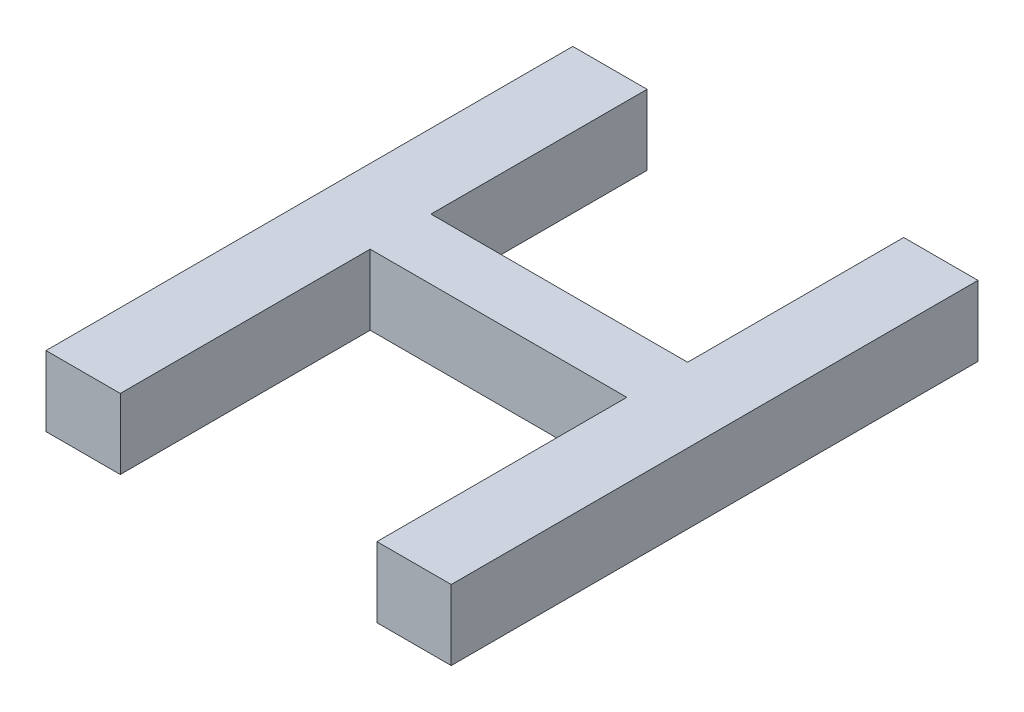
ISO-10303-21;
HEADER;
FILE_DESCRIPTION(('STEP AP214'),'2;1');
FILE_NAME('part.step','',(''),(''),'','','');
FILE_SCHEMA(('AUTOMOTIVE_DESIGN { 1 0 10303 214 1 1 1 1 }'));
ENDSEC;
DATA;
#1=APPLICATION_CONTEXT('core data for automotive mechanical design processes');
#2=APPLICATION_PROTOCOL_DEFINITION('international standard','automotive_design',2000,#1);
#3=PRODUCT_CONTEXT('',#1,'mechanical');
#4=PRODUCT('Part','Part','',(#3));
#5=PRODUCT_RELATED_PRODUCT_CATEGORY('part','',(#4));
#6=PRODUCT_DEFINITION_FORMATION('','',#4);
#7=PRODUCT_DEFINITION_CONTEXT('part definition',#1,'design');
#8=PRODUCT_DEFINITION('design','',#6,#7);
#9=PRODUCT_DEFINITION_SHAPE('','',#8);
#10=(LENGTH_UNIT() NAMED_UNIT(*) SI_UNIT(.MILLI.,.METRE.));
#11=(NAMED_UNIT(*) PLANE_ANGLE_UNIT() SI_UNIT($,.RADIAN.));
#12=(NAMED_UNIT(*) SI_UNIT($,.STERADIAN.) SOLID_ANGLE_UNIT());
#13=UNCERTAINTY_MEASURE_WITH_UNIT(LENGTH_MEASURE(1.E-05),#10,'distance_accuracy_value','');
#14=(GEOMETRIC_REPRESENTATION_CONTEXT(3) GLOBAL_UNCERTAINTY_ASSIGNED_CONTEXT((#13)) GLOBAL_UNIT_ASSIGNED_CONTEXT((#10,
#11,#12)) REPRESENTATION_CONTEXT('',''));
#15=CARTESIAN_POINT('',(0.,0.,0.));
#16=DIRECTION('',(0.,0.,1.));
#17=DIRECTION('',(1.,0.,0.));
#18=AXIS2_PLACEMENT_3D('',#15,#16,#17);
#19=CARTESIAN_POINT('',(0.,6.40004762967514,0.));
#20=DIRECTION('',(0.,1.,0.));
#21=DIRECTION('',(1.,0.,0.));
#22=AXIS2_PLACEMENT_3D('',#19,#20,#21);
#23=PLANE('',#22);
#24=DIRECTION('',(0.,0.,-1.));
#25=VECTOR('',#24,1.);
#26=CARTESIAN_POINT('',(8.92059767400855,6.40004762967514,0.));
#27=LINE('',#26,#25);
#28=CARTESIAN_POINT('',(8.92059767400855,6.40004762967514,-14.1496820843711));
#29=VERTEX_POINT('',#28);
#30=CARTESIAN_POINT('',(8.92059767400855,6.40004762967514,-14.8612205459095));
#31=VERTEX_POINT('',#30);
#32=EDGE_CURVE('E168',#29,#31,#27,.T.);
#33=ORIENTED_EDGE('',*,*,#32,.T.);
#34=DIRECTION('',(-1.,0.,0.));
#35=VECTOR('',#34,1.);
#36=CARTESIAN_POINT('',(0.,6.40004762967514,-14.8612205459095));
#37=LINE('',#36,#35);
#38=CARTESIAN_POINT('',(8.18982844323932,6.40004762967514,-14.8612205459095));
#39=VERTEX_POINT('',#38);
#40=EDGE_CURVE('E25',#31,#39,#37,.T.);
#41=ORIENTED_EDGE('',*,*,#40,.T.);
#42=DIRECTION('',(0.,0.,1.));
#43=VECTOR('',#42,1.);
#44=CARTESIAN_POINT('',(8.18982844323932,6.40004762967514,0.));
#45=LINE('',#44,#43);
#46=CARTESIAN_POINT('',(8.18982844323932,6.40004762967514,-14.1496820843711));
#47=VERTEX_POINT('',#46);
#48=EDGE_CURVE('E253',#39,#47,#45,.T.);
#49=ORIENTED_EDGE('',*,*,#48,.T.);
#50=DIRECTION('',(-1.,0.,0.));
#51=VECTOR('',#50,1.);
#52=CARTESIAN_POINT('',(0.,6.40004762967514,-14.1496820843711));
#53=LINE('',#52,#51);
#54=CARTESIAN_POINT('',(7.97828998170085,6.40004762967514,-14.1496820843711));
#55=VERTEX_POINT('',#54);
#56=EDGE_CURVE('E243',#47,#55,#53,.T.);
#57=ORIENTED_EDGE('',*,*,#56,.T.);
#58=DIRECTION('',(0.,0.,-1.));
#59=VECTOR('',#58,1.);
#60=CARTESIAN_POINT('',(7.97828998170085,6.40004762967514,0.));
#61=LINE('',#60,#59);
#62=CARTESIAN_POINT('',(7.97828998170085,6.40004762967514,-15.6496820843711));
#63=VERTEX_POINT('',#62);
#64=EDGE_CURVE('E233',#55,#63,#61,.T.);
#65=ORIENTED_EDGE('',*,*,#64,.T.);
#66=DIRECTION('',(1.,0.,0.));
#67=VECTOR('',#66,1.);
#68=CARTESIAN_POINT('',(0.,6.40004762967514,-15.6496820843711));
#69=LINE('',#68,#67);
#70=CARTESIAN_POINT('',(8.18982844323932,6.40004762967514,-15.6496820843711));
#71=VERTEX_POINT('',#70);
#72=EDGE_CURVE('E223',#63,#71,#69,.T.);
#73=ORIENTED_EDGE('',*,*,#72,.T.);
#74=DIRECTION('',(0.,0.,1.));
#75=VECTOR('',#74,1.);
#76=CARTESIAN_POINT('',(8.18982844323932,6.40004762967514,0.));
#77=LINE('',#76,#75);
#78=CARTESIAN_POINT('',(8.18982844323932,6.40004762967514,-15.0342974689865));
#79=VERTEX_POINT('',#78);
#80=EDGE_CURVE('E213',#71,#79,#77,.T.);
#81=ORIENTED_EDGE('',*,*,#80,.T.);
#82=DIRECTION('',(1.,0.,0.));
#83=VECTOR('',#82,1.);
#84=CARTESIAN_POINT('',(0.,6.40004762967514,-15.0342974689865));
#85=LINE('',#84,#83);
#86=CARTESIAN_POINT('',(8.92059767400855,6.40004762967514,-15.0342974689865));
#87=VERTEX_POINT('',#86);
#88=EDGE_CURVE('E145',#79,#87,#85,.T.);
#89=ORIENTED_EDGE('',*,*,#88,.T.);
#90=DIRECTION('',(0.,0.,-1.));
#91=VECTOR('',#90,1.);
#92=CARTESIAN_POINT('',(8.92059767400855,6.40004762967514,0.));
#93=LINE('',#92,#91);
#94=CARTESIAN_POINT('',(8.92059767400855,6.40004762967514,-15.6496820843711));
#95=VERTEX_POINT('',#94);
#96=EDGE_CURVE('E157',#87,#95,#93,.T.);
#97=ORIENTED_EDGE('',*,*,#96,.T.);
#98=DIRECTION('',(1.,0.,0.));
#99=VECTOR('',#98,1.);
#100=CARTESIAN_POINT('',(0.,6.40004762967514,-15.6496820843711));
#101=LINE('',#100,#99);
#102=CARTESIAN_POINT('',(9.13213613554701,6.40004762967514,-15.6496820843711));
#103=VERTEX_POINT('',#102);
#104=EDGE_CURVE('E160',#95,#103,#101,.T.);
#105=ORIENTED_EDGE('',*,*,#104,.T.);
#106=DIRECTION('',(0.,0.,1.));
#107=VECTOR('',#106,1.);
#108=CARTESIAN_POINT('',(9.13213613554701,6.40004762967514,0.));
#109=LINE('',#108,#107);
#110=CARTESIAN_POINT('',(9.13213613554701,6.40004762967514,-14.1496820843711));
#111=VERTEX_POINT('',#110);
#112=EDGE_CURVE('E196',#103,#111,#109,.T.);
#113=ORIENTED_EDGE('',*,*,#112,.T.);
#114=DIRECTION('',(-1.,0.,0.));
#115=VECTOR('',#114,1.);
#116=CARTESIAN_POINT('',(0.,6.40004762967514,-14.1496820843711));
#117=LINE('',#116,#115);
#118=EDGE_CURVE('E186',#111,#29,#117,.T.);
#119=ORIENTED_EDGE('',*,*,#118,.T.);
#120=EDGE_LOOP('',(#33,#41,#49,#57,#65,#73,#81,#89,#97,#105,#113,#119));
#121=FACE_BOUND('',#120,.T.);
#122=ADVANCED_FACE('F16',(#121),#23,.F.);
#123=CARTESIAN_POINT('',(0.,6.60004762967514,0.));
#124=DIRECTION('',(0.,1.,0.));
#125=DIRECTION('',(1.,0.,0.));
#126=AXIS2_PLACEMENT_3D('',#123,#124,#125);
#127=PLANE('',#126);
#128=DIRECTION('',(0.,0.,-1.));
#129=VECTOR('',#128,1.);
#130=CARTESIAN_POINT('',(8.92059767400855,6.60004762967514,0.));
#131=LINE('',#130,#129);
#132=CARTESIAN_POINT('',(8.92059767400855,6.60004762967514,-14.1496820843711));
#133=VERTEX_POINT('',#132);
#134=CARTESIAN_POINT('',(8.92059767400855,6.60004762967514,-14.8612205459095));
#135=VERTEX_POINT('',#134);
#136=EDGE_CURVE('E174',#133,#135,#131,.T.);
#137=ORIENTED_EDGE('',*,*,#136,.F.);
#138=DIRECTION('',(-1.,0.,0.));
#139=VECTOR('',#138,1.);
#140=CARTESIAN_POINT('',(0.,6.60004762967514,-14.1496820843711));
#141=LINE('',#140,#139);
#142=CARTESIAN_POINT('',(9.13213613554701,6.60004762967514,-14.1496820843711));
#143=VERTEX_POINT('',#142);
#144=EDGE_CURVE('E193',#143,#133,#141,.T.);
#145=ORIENTED_EDGE('',*,*,#144,.F.);
#146=DIRECTION('',(0.,0.,1.));
#147=VECTOR('',#146,1.);
#148=CARTESIAN_POINT('',(9.13213613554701,6.60004762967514,0.));
#149=LINE('',#148,#147);
#150=CARTESIAN_POINT('',(9.13213613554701,6.60004762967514,-15.6496820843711));
#151=VERTEX_POINT('',#150);
#152=EDGE_CURVE('E152',#151,#143,#149,.T.);
#153=ORIENTED_EDGE('',*,*,#152,.F.);
#154=DIRECTION('',(1.,0.,0.));
#155=VECTOR('',#154,1.);
#156=CARTESIAN_POINT('',(0.,6.60004762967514,-15.6496820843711));
#157=LINE('',#156,#155);
#158=CARTESIAN_POINT('',(8.92059767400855,6.60004762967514,-15.6496820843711));
#159=VERTEX_POINT('',#158);
#160=EDGE_CURVE('E148',#159,#151,#157,.T.);
#161=ORIENTED_EDGE('',*,*,#160,.F.);
#162=DIRECTION('',(0.,0.,-1.));
#163=VECTOR('',#162,1.);
#164=CARTESIAN_POINT('',(8.92059767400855,6.60004762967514,0.));
#165=LINE('',#164,#163);
#166=CARTESIAN_POINT('',(8.92059767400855,6.60004762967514,-15.0342974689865));
#167=VERTEX_POINT('',#166);
#168=EDGE_CURVE('E133',#167,#159,#165,.T.);
#169=ORIENTED_EDGE('',*,*,#168,.F.);
#170=DIRECTION('',(1.,0.,0.));
#171=VECTOR('',#170,1.);
#172=CARTESIAN_POINT('',(0.,6.60004762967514,-15.0342974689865));
#173=LINE('',#172,#171);
#174=CARTESIAN_POINT('',(8.18982844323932,6.60004762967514,-15.0342974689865));
#175=VERTEX_POINT('',#174);
#176=EDGE_CURVE('E210',#175,#167,#173,.T.);
#177=ORIENTED_EDGE('',*,*,#176,.F.);
#178=DIRECTION('',(0.,0.,1.));
#179=VECTOR('',#178,1.);
#180=CARTESIAN_POINT('',(8.18982844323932,6.60004762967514,0.));
#181=LINE('',#180,#179);
#182=CARTESIAN_POINT('',(8.18982844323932,6.60004762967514,-15.6496820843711));
#183=VERTEX_POINT('',#182);
#184=EDGE_CURVE('E220',#183,#175,#181,.T.);
#185=ORIENTED_EDGE('',*,*,#184,.F.);
#186=DIRECTION('',(1.,0.,0.));
#187=VECTOR('',#186,1.);
#188=CARTESIAN_POINT('',(0.,6.60004762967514,-15.6496820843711));
#189=LINE('',#188,#187);
#190=CARTESIAN_POINT('',(7.97828998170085,6.60004762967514,-15.6496820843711));
#191=VERTEX_POINT('',#190);
#192=EDGE_CURVE('E230',#191,#183,#189,.T.);
#193=ORIENTED_EDGE('',*,*,#192,.F.);
#194=DIRECTION('',(0.,0.,-1.));
#195=VECTOR('',#194,1.);
#196=CARTESIAN_POINT('',(7.97828998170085,6.60004762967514,0.));
#197=LINE('',#196,#195);
#198=CARTESIAN_POINT('',(7.97828998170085,6.60004762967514,-14.1496820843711));
#199=VERTEX_POINT('',#198);
#200=EDGE_CURVE('E240',#199,#191,#197,.T.);
#201=ORIENTED_EDGE('',*,*,#200,.F.);
#202=DIRECTION('',(-1.,0.,0.));
#203=VECTOR('',#202,1.);
#204=CARTESIAN_POINT('',(0.,6.60004762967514,-14.1496820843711));
#205=LINE('',#204,#203);
#206=CARTESIAN_POINT('',(8.18982844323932,6.60004762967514,-14.1496820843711));
#207=VERTEX_POINT('',#206);
#208=EDGE_CURVE('E250',#207,#199,#205,.T.);
#209=ORIENTED_EDGE('',*,*,#208,.F.);
#210=DIRECTION('',(0.,0.,1.));
#211=VECTOR('',#210,1.);
#212=CARTESIAN_POINT('',(8.18982844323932,6.60004762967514,0.));
#213=LINE('',#212,#211);
#214=CARTESIAN_POINT('',(8.18982844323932,6.60004762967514,-14.8612205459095));
#215=VERTEX_POINT('',#214);
#216=EDGE_CURVE('E259',#215,#207,#213,.T.);
#217=ORIENTED_EDGE('',*,*,#216,.F.);
#218=DIRECTION('',(-1.,0.,0.));
#219=VECTOR('',#218,1.);
#220=CARTESIAN_POINT('',(0.,6.60004762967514,-14.8612205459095));
#221=LINE('',#220,#219);
#222=EDGE_CURVE('E11',#135,#215,#221,.T.);
#223=ORIENTED_EDGE('',*,*,#222,.F.);
#224=EDGE_LOOP('',(#137,#145,#153,#161,#169,#177,#185,#193,#201,#209,#217,#223));
#225=FACE_BOUND('',#224,.T.);
#226=ADVANCED_FACE('F150',(#225),#127,.T.);
#227=CARTESIAN_POINT('',(0.,6.60004762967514,-14.8612205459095));
#228=DIRECTION('',(0.,0.,1.));
#229=DIRECTION('',(1.,0.,0.));
#230=AXIS2_PLACEMENT_3D('',#227,#228,#229);
#231=PLANE('',#230);
#232=ORIENTED_EDGE('',*,*,#40,.F.);
#233=DIRECTION('',(0.,-1.,0.));
#234=VECTOR('',#233,1.);
#235=CARTESIAN_POINT('',(8.92059767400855,6.60004762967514,-14.8612205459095));
#236=LINE('',#235,#234);
#237=EDGE_CURVE('E180',#135,#31,#236,.T.);
#238=ORIENTED_EDGE('',*,*,#237,.F.);
#239=ORIENTED_EDGE('',*,*,#222,.T.);
#240=DIRECTION('',(0.,-1.,0.));
#241=VECTOR('',#240,1.);
#242=CARTESIAN_POINT('',(8.18982844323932,6.60004762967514,-14.8612205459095));
#243=LINE('',#242,#241);
#244=EDGE_CURVE('E256',#215,#39,#243,.T.);
#245=ORIENTED_EDGE('',*,*,#244,.T.);
#246=EDGE_LOOP('',(#232,#238,#239,#245));
#247=FACE_BOUND('',#246,.T.);
#248=ADVANCED_FACE('F18',(#247),#231,.T.);
#249=CARTESIAN_POINT('',(8.18982844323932,6.60004762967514,0.));
#250=DIRECTION('',(1.,0.,0.));
#251=DIRECTION('',(0.,-1.,0.));
#252=AXIS2_PLACEMENT_3D('',#249,#250,#251);
#253=PLANE('',#252);
#254=ORIENTED_EDGE('',*,*,#48,.F.);
#255=ORIENTED_EDGE('',*,*,#244,.F.);
#256=ORIENTED_EDGE('',*,*,#216,.T.);
#257=DIRECTION('',(0.,-1.,0.));
#258=VECTOR('',#257,1.);
#259=CARTESIAN_POINT('',(8.18982844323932,6.60004762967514,-14.1496820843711));
#260=LINE('',#259,#258);
#261=EDGE_CURVE('E246',#207,#47,#260,.T.);
#262=ORIENTED_EDGE('',*,*,#261,.T.);
#263=EDGE_LOOP('',(#254,#255,#256,#262));
#264=FACE_BOUND('',#263,.T.);
#265=ADVANCED_FACE('F370',(#264),#253,.T.);
#266=CARTESIAN_POINT('',(0.,6.60004762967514,-14.1496820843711));
#267=DIRECTION('',(0.,0.,1.));
#268=DIRECTION('',(1.,0.,0.));
#269=AXIS2_PLACEMENT_3D('',#266,#267,#268);
#270=PLANE('',#269);
#271=ORIENTED_EDGE('',*,*,#56,.F.);
#272=ORIENTED_EDGE('',*,*,#261,.F.);
#273=ORIENTED_EDGE('',*,*,#208,.T.);
#274=DIRECTION('',(0.,-1.,0.));
#275=VECTOR('',#274,1.);
#276=CARTESIAN_POINT('',(7.97828998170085,6.60004762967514,-14.1496820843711));
#277=LINE('',#276,#275);
#278=EDGE_CURVE('E236',#199,#55,#277,.T.);
#279=ORIENTED_EDGE('',*,*,#278,.T.);
#280=EDGE_LOOP('',(#271,#272,#273,#279));
#281=FACE_BOUND('',#280,.T.);
#282=ADVANCED_FACE('F360',(#281),#270,.T.);
#283=CARTESIAN_POINT('',(7.97828998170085,6.60004762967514,0.));
#284=DIRECTION('',(-1.,0.,0.));
#285=DIRECTION('',(0.,0.,1.));
#286=AXIS2_PLACEMENT_3D('',#283,#284,#285);
#287=PLANE('',#286);
#288=ORIENTED_EDGE('',*,*,#64,.F.);
#289=ORIENTED_EDGE('',*,*,#278,.F.);
#290=ORIENTED_EDGE('',*,*,#200,.T.);
#291=DIRECTION('',(0.,-1.,0.));
#292=VECTOR('',#291,1.);
#293=CARTESIAN_POINT('',(7.97828998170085,6.60004762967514,-15.6496820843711));
#294=LINE('',#293,#292);
#295=EDGE_CURVE('E226',#191,#63,#294,.T.);
#296=ORIENTED_EDGE('',*,*,#295,.T.);
#297=EDGE_LOOP('',(#288,#289,#290,#296));
#298=FACE_BOUND('',#297,.T.);
#299=ADVANCED_FACE('F274',(#298),#287,.T.);
#300=CARTESIAN_POINT('',(0.,6.60004762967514,-15.6496820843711));
#301=DIRECTION('',(0.,0.,-1.));
#302=DIRECTION('',(0.,-1.,0.));
#303=AXIS2_PLACEMENT_3D('',#300,#301,#302);
#304=PLANE('',#303);
#305=ORIENTED_EDGE('',*,*,#72,.F.);
#306=ORIENTED_EDGE('',*,*,#295,.F.);
#307=ORIENTED_EDGE('',*,*,#192,.T.);
#308=DIRECTION('',(0.,-1.,0.));
#309=VECTOR('',#308,1.);
#310=CARTESIAN_POINT('',(8.18982844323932,6.60004762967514,-15.6496820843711));
#311=LINE('',#310,#309);
#312=EDGE_CURVE('E216',#183,#71,#311,.T.);
#313=ORIENTED_EDGE('',*,*,#312,.T.);
#314=EDGE_LOOP('',(#305,#306,#307,#313));
#315=FACE_BOUND('',#314,.T.);
#316=ADVANCED_FACE('F268',(#315),#304,.T.);
#317=CARTESIAN_POINT('',(8.18982844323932,6.60004762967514,0.));
#318=DIRECTION('',(1.,0.,0.));
#319=DIRECTION('',(0.,-1.,0.));
#320=AXIS2_PLACEMENT_3D('',#317,#318,#319);
#321=PLANE('',#320);
#322=ORIENTED_EDGE('',*,*,#80,.F.);
#323=ORIENTED_EDGE('',*,*,#312,.F.);
#324=ORIENTED_EDGE('',*,*,#184,.T.);
#325=DIRECTION('',(0.,-1.,0.));
#326=VECTOR('',#325,1.);
#327=CARTESIAN_POINT('',(8.18982844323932,6.60004762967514,-15.0342974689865));
#328=LINE('',#327,#326);
#329=EDGE_CURVE('E206',#175,#79,#328,.T.);
#330=ORIENTED_EDGE('',*,*,#329,.T.);
#331=EDGE_LOOP('',(#322,#323,#324,#330));
#332=FACE_BOUND('',#331,.T.);
#333=ADVANCED_FACE('F273',(#332),#321,.T.);
#334=CARTESIAN_POINT('',(0.,6.60004762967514,-15.0342974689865));
#335=DIRECTION('',(0.,0.,-1.));
#336=DIRECTION('',(0.,-1.,0.));
#337=AXIS2_PLACEMENT_3D('',#334,#335,#336);
#338=PLANE('',#337);
#339=ORIENTED_EDGE('',*,*,#88,.F.);
#340=ORIENTED_EDGE('',*,*,#329,.F.);
#341=ORIENTED_EDGE('',*,*,#176,.T.);
#342=DIRECTION('',(0.,-1.,0.));
#343=VECTOR('',#342,1.);
#344=CARTESIAN_POINT('',(8.92059767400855,6.60004762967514,-15.0342974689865));
#345=LINE('',#344,#343);
#346=EDGE_CURVE('E141',#167,#87,#345,.T.);
#347=ORIENTED_EDGE('',*,*,#346,.T.);
#348=EDGE_LOOP('',(#339,#340,#341,#347));
#349=FACE_BOUND('',#348,.T.);
#350=ADVANCED_FACE('F325',(#349),#338,.T.);
#351=CARTESIAN_POINT('',(8.92059767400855,6.60004762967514,0.));
#352=DIRECTION('',(-1.,0.,0.));
#353=DIRECTION('',(0.,0.,1.));
#354=AXIS2_PLACEMENT_3D('',#351,#352,#353);
#355=PLANE('',#354);
#356=ORIENTED_EDGE('',*,*,#96,.F.);
#357=ORIENTED_EDGE('',*,*,#346,.F.);
#358=ORIENTED_EDGE('',*,*,#168,.T.);
#359=DIRECTION('',(0.,-1.,0.));
#360=VECTOR('',#359,1.);
#361=CARTESIAN_POINT('',(8.92059767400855,6.60004762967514,-15.6496820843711));
#362=LINE('',#361,#360);
#363=EDGE_CURVE('E138',#159,#95,#362,.T.);
#364=ORIENTED_EDGE('',*,*,#363,.T.);
#365=EDGE_LOOP('',(#356,#357,#358,#364));
#366=FACE_BOUND('',#365,.T.);
#367=ADVANCED_FACE('F136',(#366),#355,.T.);
#368=CARTESIAN_POINT('',(0.,6.60004762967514,-15.6496820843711));
#369=DIRECTION('',(0.,0.,-1.));
#370=DIRECTION('',(0.,-1.,0.));
#371=AXIS2_PLACEMENT_3D('',#368,#369,#370);
#372=PLANE('',#371);
#373=ORIENTED_EDGE('',*,*,#104,.F.);
#374=ORIENTED_EDGE('',*,*,#363,.F.);
#375=ORIENTED_EDGE('',*,*,#160,.T.);
#376=DIRECTION('',(0.,-1.,0.));
#377=VECTOR('',#376,1.);
#378=CARTESIAN_POINT('',(9.13213613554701,6.60004762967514,-15.6496820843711));
#379=LINE('',#378,#377);
#380=EDGE_CURVE('E199',#151,#103,#379,.T.);
#381=ORIENTED_EDGE('',*,*,#380,.T.);
#382=EDGE_LOOP('',(#373,#374,#375,#381));
#383=FACE_BOUND('',#382,.T.);
#384=ADVANCED_FACE('F159',(#383),#372,.T.);
#385=CARTESIAN_POINT('',(9.13213613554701,6.60004762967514,0.));
#386=DIRECTION('',(1.,0.,0.));
#387=DIRECTION('',(0.,-1.,0.));
#388=AXIS2_PLACEMENT_3D('',#385,#386,#387);
#389=PLANE('',#388);
#390=ORIENTED_EDGE('',*,*,#112,.F.);
#391=ORIENTED_EDGE('',*,*,#380,.F.);
#392=ORIENTED_EDGE('',*,*,#152,.T.);
#393=DIRECTION('',(0.,-1.,0.));
#394=VECTOR('',#393,1.);
#395=CARTESIAN_POINT('',(9.13213613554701,6.60004762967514,-14.1496820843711));
#396=LINE('',#395,#394);
#397=EDGE_CURVE('E189',#143,#111,#396,.T.);
#398=ORIENTED_EDGE('',*,*,#397,.T.);
#399=EDGE_LOOP('',(#390,#391,#392,#398));
#400=FACE_BOUND('',#399,.T.);
#401=ADVANCED_FACE('F298',(#400),#389,.T.);
#402=CARTESIAN_POINT('',(0.,6.60004762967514,-14.1496820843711));
#403=DIRECTION('',(0.,0.,1.));
#404=DIRECTION('',(1.,0.,0.));
#405=AXIS2_PLACEMENT_3D('',#402,#403,#404);
#406=PLANE('',#405);
#407=ORIENTED_EDGE('',*,*,#118,.F.);
#408=ORIENTED_EDGE('',*,*,#397,.F.);
#409=ORIENTED_EDGE('',*,*,#144,.T.);
#410=DIRECTION('',(0.,-1.,0.));
#411=VECTOR('',#410,1.);
#412=CARTESIAN_POINT('',(8.92059767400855,6.60004762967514,-14.1496820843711));
#413=LINE('',#412,#411);
#414=EDGE_CURVE('E170',#133,#29,#413,.T.);
#415=ORIENTED_EDGE('',*,*,#414,.T.);
#416=EDGE_LOOP('',(#407,#408,#409,#415));
#417=FACE_BOUND('',#416,.T.);
#418=ADVANCED_FACE('F288',(#417),#406,.T.);
#419=CARTESIAN_POINT('',(8.92059767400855,6.60004762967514,0.));
#420=DIRECTION('',(-1.,0.,0.));
#421=DIRECTION('',(0.,0.,1.));
#422=AXIS2_PLACEMENT_3D('',#419,#420,#421);
#423=PLANE('',#422);
#424=ORIENTED_EDGE('',*,*,#32,.F.);
#425=ORIENTED_EDGE('',*,*,#414,.F.);
#426=ORIENTED_EDGE('',*,*,#136,.T.);
#427=ORIENTED_EDGE('',*,*,#237,.T.);
#428=EDGE_LOOP('',(#424,#425,#426,#427));
#429=FACE_BOUND('',#428,.T.);
#430=ADVANCED_FACE('F283',(#429),#423,.T.);
#431=CLOSED_SHELL('',(#122,#226,#248,#265,#282,#299,#316,#333,#350,#367,#384,#401,#418,#430));
#432=MANIFOLD_SOLID_BREP('B1',#431);
#433=ADVANCED_BREP_SHAPE_REPRESENTATION('',(#18,#432),#14);
#434=SHAPE_DEFINITION_REPRESENTATION(#9,#433);
ENDSEC;
END-ISO-10303-21;
